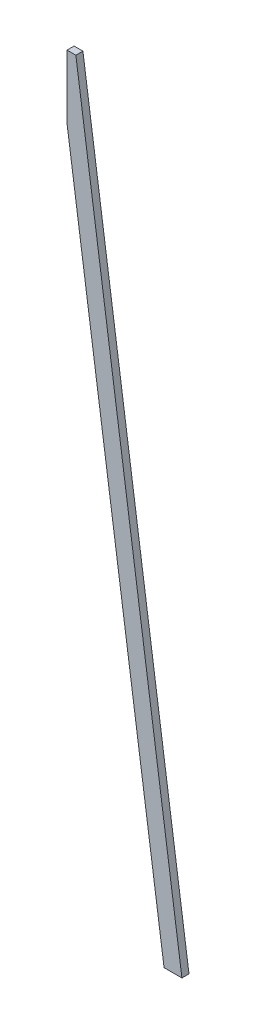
ISO-10303-21;
HEADER;
FILE_DESCRIPTION(('STEP AP214'),'2;1');
FILE_NAME('part.step','',(''),(''),'','','');
FILE_SCHEMA(('AUTOMOTIVE_DESIGN { 1 0 10303 214 1 1 1 1 }'));
ENDSEC;
DATA;
#1=APPLICATION_CONTEXT('core data for automotive mechanical design processes');
#2=APPLICATION_PROTOCOL_DEFINITION('international standard','automotive_design',2000,#1);
#3=PRODUCT_CONTEXT('',#1,'mechanical');
#4=PRODUCT('Part','Part','',(#3));
#5=PRODUCT_RELATED_PRODUCT_CATEGORY('part','',(#4));
#6=PRODUCT_DEFINITION_FORMATION('','',#4);
#7=PRODUCT_DEFINITION_CONTEXT('part definition',#1,'design');
#8=PRODUCT_DEFINITION('design','',#6,#7);
#9=PRODUCT_DEFINITION_SHAPE('','',#8);
#10=(LENGTH_UNIT() NAMED_UNIT(*) SI_UNIT(.MILLI.,.METRE.));
#11=(NAMED_UNIT(*) PLANE_ANGLE_UNIT() SI_UNIT($,.RADIAN.));
#12=(NAMED_UNIT(*) SI_UNIT($,.STERADIAN.) SOLID_ANGLE_UNIT());
#13=UNCERTAINTY_MEASURE_WITH_UNIT(LENGTH_MEASURE(1.E-05),#10,'distance_accuracy_value','');
#14=(GEOMETRIC_REPRESENTATION_CONTEXT(3) GLOBAL_UNCERTAINTY_ASSIGNED_CONTEXT((#13)) GLOBAL_UNIT_ASSIGNED_CONTEXT((#10,
#11,#12)) REPRESENTATION_CONTEXT('',''));
#15=CARTESIAN_POINT('',(0.,0.,0.));
#16=DIRECTION('',(0.,0.,1.));
#17=DIRECTION('',(1.,0.,0.));
#18=AXIS2_PLACEMENT_3D('',#15,#16,#17);
#19=CARTESIAN_POINT('',(60.5197581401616,419.357385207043,8.));
#20=DIRECTION('',(0.,0.,1.));
#21=DIRECTION('',(1.,0.,0.));
#22=AXIS2_PLACEMENT_3D('',#19,#20,#21);
#23=PLANE('',#22);
#24=DIRECTION('',(1.,0.,0.));
#25=VECTOR('',#24,1.);
#26=CARTESIAN_POINT('',(10.,844.,8.));
#27=LINE('',#26,#25);
#28=CARTESIAN_POINT('',(0.,844.,8.));
#29=VERTEX_POINT('',#28);
#30=CARTESIAN_POINT('',(9.99999999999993,844.,8.));
#31=VERTEX_POINT('',#30);
#32=EDGE_CURVE('E60',#29,#31,#27,.T.);
#33=ORIENTED_EDGE('',*,*,#32,.F.);
#34=DIRECTION('',(0.,1.,0.));
#35=VECTOR('',#34,1.);
#36=CARTESIAN_POINT('',(0.,844.,8.));
#37=LINE('',#36,#35);
#38=CARTESIAN_POINT('',(0.,772.25197948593,8.));
#39=VERTEX_POINT('',#38);
#40=EDGE_CURVE('E87',#39,#29,#37,.T.);
#41=ORIENTED_EDGE('',*,*,#40,.F.);
#42=DIRECTION('',(0.140764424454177,-0.990043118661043,0.));
#43=VECTOR('',#42,1.);
#44=CARTESIAN_POINT('',(0.,772.25197948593,8.));
#45=LINE('',#44,#43);
#46=CARTESIAN_POINT('',(109.798859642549,0.,8.));
#47=VERTEX_POINT('',#46);
#48=EDGE_CURVE('E76',#47,#39,#45,.F.);
#49=ORIENTED_EDGE('',*,*,#48,.F.);
#50=DIRECTION('',(1.,0.,0.));
#51=VECTOR('',#50,1.);
#52=CARTESIAN_POINT('',(109.798859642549,0.,8.));
#53=LINE('',#52,#51);
#54=CARTESIAN_POINT('',(130.,0.,8.));
#55=VERTEX_POINT('',#54);
#56=EDGE_CURVE('E20',#55,#47,#53,.F.);
#57=ORIENTED_EDGE('',*,*,#56,.F.);
#58=DIRECTION('',(-0.140764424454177,0.990043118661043,0.));
#59=VECTOR('',#58,1.);
#60=CARTESIAN_POINT('',(130.,-1.4210854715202E-13,8.));
#61=LINE('',#60,#59);
#62=EDGE_CURVE('E65',#31,#55,#61,.F.);
#63=ORIENTED_EDGE('',*,*,#62,.F.);
#64=EDGE_LOOP('',(#33,#41,#49,#57,#63));
#65=FACE_BOUND('',#64,.T.);
#66=ADVANCED_FACE('F17',(#65),#23,.T.);
#67=CARTESIAN_POINT('',(109.798859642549,0.,0.));
#68=DIRECTION('',(0.,-1.,0.));
#69=DIRECTION('',(1.,0.,0.));
#70=AXIS2_PLACEMENT_3D('',#67,#68,#69);
#71=PLANE('',#70);
#72=ORIENTED_EDGE('',*,*,#56,.T.);
#73=DIRECTION('',(0.,0.,1.));
#74=VECTOR('',#73,1.);
#75=CARTESIAN_POINT('',(109.798859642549,2.22044604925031E-13,0.));
#76=LINE('',#75,#74);
#77=CARTESIAN_POINT('',(109.798859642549,0.,0.));
#78=VERTEX_POINT('',#77);
#79=EDGE_CURVE('E91',#78,#47,#76,.T.);
#80=ORIENTED_EDGE('',*,*,#79,.F.);
#81=DIRECTION('',(1.,0.,0.));
#82=VECTOR('',#81,1.);
#83=CARTESIAN_POINT('',(60.5197581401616,0.,0.));
#84=LINE('',#83,#82);
#85=CARTESIAN_POINT('',(130.,0.,0.));
#86=VERTEX_POINT('',#85);
#87=EDGE_CURVE('E82',#78,#86,#84,.T.);
#88=ORIENTED_EDGE('',*,*,#87,.T.);
#89=DIRECTION('',(0.,0.,1.));
#90=VECTOR('',#89,1.);
#91=CARTESIAN_POINT('',(130.,0.,0.));
#92=LINE('',#91,#90);
#93=EDGE_CURVE('E70',#55,#86,#92,.F.);
#94=ORIENTED_EDGE('',*,*,#93,.F.);
#95=EDGE_LOOP('',(#72,#80,#88,#94));
#96=FACE_BOUND('',#95,.T.);
#97=ADVANCED_FACE('F81',(#96),#71,.T.);
#98=CARTESIAN_POINT('',(130.,-1.4210854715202E-13,0.));
#99=DIRECTION('',(0.990043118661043,0.140764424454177,0.));
#100=DIRECTION('',(-0.140764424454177,0.990043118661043,0.));
#101=AXIS2_PLACEMENT_3D('',#98,#99,#100);
#102=PLANE('',#101);
#103=ORIENTED_EDGE('',*,*,#62,.T.);
#104=ORIENTED_EDGE('',*,*,#93,.T.);
#105=DIRECTION('',(-0.140764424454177,0.990043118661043,0.));
#106=VECTOR('',#105,1.);
#107=CARTESIAN_POINT('',(130.,0.,0.));
#108=LINE('',#107,#106);
#109=CARTESIAN_POINT('',(9.99999999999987,844.,0.));
#110=VERTEX_POINT('',#109);
#111=EDGE_CURVE('E96',#86,#110,#108,.T.);
#112=ORIENTED_EDGE('',*,*,#111,.T.);
#113=DIRECTION('',(0.,0.,1.));
#114=VECTOR('',#113,1.);
#115=CARTESIAN_POINT('',(10.,844.,0.));
#116=LINE('',#115,#114);
#117=EDGE_CURVE('E72',#31,#110,#116,.F.);
#118=ORIENTED_EDGE('',*,*,#117,.F.);
#119=EDGE_LOOP('',(#103,#104,#112,#118));
#120=FACE_BOUND('',#119,.T.);
#121=ADVANCED_FACE('F67',(#120),#102,.T.);
#122=CARTESIAN_POINT('',(10.,844.,0.));
#123=DIRECTION('',(0.,1.,0.));
#124=DIRECTION('',(0.,0.,1.));
#125=AXIS2_PLACEMENT_3D('',#122,#123,#124);
#126=PLANE('',#125);
#127=ORIENTED_EDGE('',*,*,#32,.T.);
#128=ORIENTED_EDGE('',*,*,#117,.T.);
#129=DIRECTION('',(1.,0.,0.));
#130=VECTOR('',#129,1.);
#131=CARTESIAN_POINT('',(60.5197581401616,844.,0.));
#132=LINE('',#131,#130);
#133=CARTESIAN_POINT('',(0.,844.,0.));
#134=VERTEX_POINT('',#133);
#135=EDGE_CURVE('E98',#110,#134,#132,.F.);
#136=ORIENTED_EDGE('',*,*,#135,.T.);
#137=DIRECTION('',(0.,0.,1.));
#138=VECTOR('',#137,1.);
#139=CARTESIAN_POINT('',(0.,844.,0.));
#140=LINE('',#139,#138);
#141=EDGE_CURVE('E89',#29,#134,#140,.F.);
#142=ORIENTED_EDGE('',*,*,#141,.F.);
#143=EDGE_LOOP('',(#127,#128,#136,#142));
#144=FACE_BOUND('',#143,.T.);
#145=ADVANCED_FACE('F108',(#144),#126,.T.);
#146=CARTESIAN_POINT('',(0.,844.,0.));
#147=DIRECTION('',(-1.,0.,0.));
#148=DIRECTION('',(0.,0.,1.));
#149=AXIS2_PLACEMENT_3D('',#146,#147,#148);
#150=PLANE('',#149);
#151=ORIENTED_EDGE('',*,*,#40,.T.);
#152=ORIENTED_EDGE('',*,*,#141,.T.);
#153=DIRECTION('',(0.,1.,0.));
#154=VECTOR('',#153,1.);
#155=CARTESIAN_POINT('',(0.,419.357385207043,0.));
#156=LINE('',#155,#154);
#157=CARTESIAN_POINT('',(0.,772.251979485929,0.));
#158=VERTEX_POINT('',#157);
#159=EDGE_CURVE('E26',#134,#158,#156,.F.);
#160=ORIENTED_EDGE('',*,*,#159,.T.);
#161=DIRECTION('',(0.,0.,1.));
#162=VECTOR('',#161,1.);
#163=CARTESIAN_POINT('',(0.,772.25197948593,0.));
#164=LINE('',#163,#162);
#165=EDGE_CURVE('E34',#39,#158,#164,.F.);
#166=ORIENTED_EDGE('',*,*,#165,.F.);
#167=EDGE_LOOP('',(#151,#152,#160,#166));
#168=FACE_BOUND('',#167,.T.);
#169=ADVANCED_FACE('F104',(#168),#150,.T.);
#170=CARTESIAN_POINT('',(0.,772.25197948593,0.));
#171=DIRECTION('',(-0.990043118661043,-0.140764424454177,0.));
#172=DIRECTION('',(0.140764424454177,-0.990043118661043,0.));
#173=AXIS2_PLACEMENT_3D('',#170,#171,#172);
#174=PLANE('',#173);
#175=ORIENTED_EDGE('',*,*,#48,.T.);
#176=ORIENTED_EDGE('',*,*,#165,.T.);
#177=DIRECTION('',(0.140764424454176,-0.990043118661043,0.));
#178=VECTOR('',#177,1.);
#179=CARTESIAN_POINT('',(0.,772.25197948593,0.));
#180=LINE('',#179,#178);
#181=EDGE_CURVE('E11',#158,#78,#180,.T.);
#182=ORIENTED_EDGE('',*,*,#181,.T.);
#183=ORIENTED_EDGE('',*,*,#79,.T.);
#184=EDGE_LOOP('',(#175,#176,#182,#183));
#185=FACE_BOUND('',#184,.T.);
#186=ADVANCED_FACE('F116',(#185),#174,.T.);
#187=CARTESIAN_POINT('',(60.5197581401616,419.357385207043,0.));
#188=DIRECTION('',(0.,0.,1.));
#189=DIRECTION('',(1.,0.,0.));
#190=AXIS2_PLACEMENT_3D('',#187,#188,#189);
#191=PLANE('',#190);
#192=ORIENTED_EDGE('',*,*,#159,.F.);
#193=ORIENTED_EDGE('',*,*,#135,.F.);
#194=ORIENTED_EDGE('',*,*,#111,.F.);
#195=ORIENTED_EDGE('',*,*,#87,.F.);
#196=ORIENTED_EDGE('',*,*,#181,.F.);
#197=EDGE_LOOP('',(#192,#193,#194,#195,#196));
#198=FACE_BOUND('',#197,.T.);
#199=ADVANCED_FACE('F107',(#198),#191,.F.);
#200=CLOSED_SHELL('',(#66,#97,#121,#145,#169,#186,#199));
#201=MANIFOLD_SOLID_BREP('B1',#200);
#202=ADVANCED_BREP_SHAPE_REPRESENTATION('',(#18,#201),#14);
#203=SHAPE_DEFINITION_REPRESENTATION(#9,#202);
ENDSEC;
END-ISO-10303-21;
